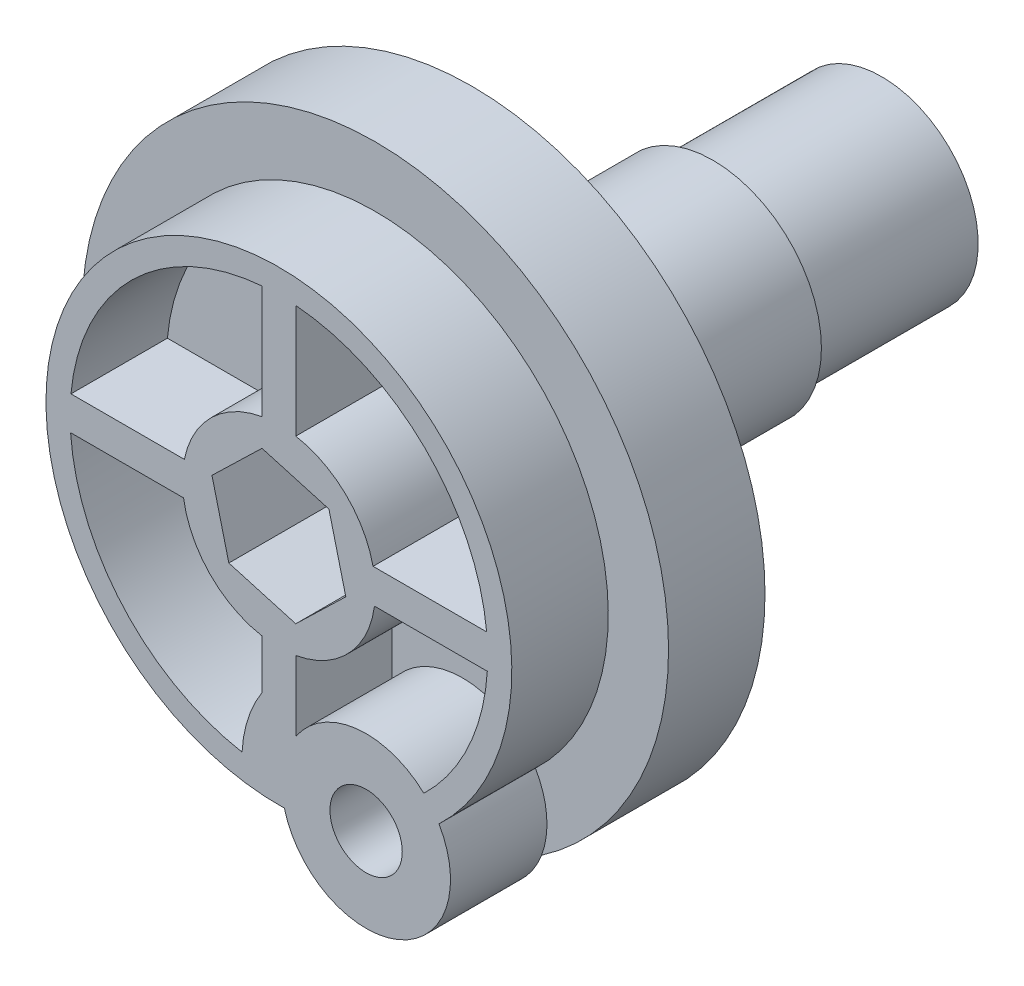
ISO-10303-21;
HEADER;
FILE_DESCRIPTION(('STEP AP214'),'2;1');
FILE_NAME('part.step','',(''),(''),'','','');
FILE_SCHEMA(('AUTOMOTIVE_DESIGN { 1 0 10303 214 1 1 1 1 }'));
ENDSEC;
DATA;
#1=APPLICATION_CONTEXT('core data for automotive mechanical design processes');
#2=APPLICATION_PROTOCOL_DEFINITION('international standard','automotive_design',2000,#1);
#3=PRODUCT_CONTEXT('',#1,'mechanical');
#4=PRODUCT('Part','Part','',(#3));
#5=PRODUCT_RELATED_PRODUCT_CATEGORY('part','',(#4));
#6=PRODUCT_DEFINITION_FORMATION('','',#4);
#7=PRODUCT_DEFINITION_CONTEXT('part definition',#1,'design');
#8=PRODUCT_DEFINITION('design','',#6,#7);
#9=PRODUCT_DEFINITION_SHAPE('','',#8);
#10=(LENGTH_UNIT() NAMED_UNIT(*) SI_UNIT(.MILLI.,.METRE.));
#11=(NAMED_UNIT(*) PLANE_ANGLE_UNIT() SI_UNIT($,.RADIAN.));
#12=(NAMED_UNIT(*) SI_UNIT($,.STERADIAN.) SOLID_ANGLE_UNIT());
#13=UNCERTAINTY_MEASURE_WITH_UNIT(LENGTH_MEASURE(1.E-05),#10,'distance_accuracy_value','');
#14=(GEOMETRIC_REPRESENTATION_CONTEXT(3) GLOBAL_UNCERTAINTY_ASSIGNED_CONTEXT((#13)) GLOBAL_UNIT_ASSIGNED_CONTEXT((#10,
#11,#12)) REPRESENTATION_CONTEXT('',''));
#15=CARTESIAN_POINT('',(0.,0.,0.));
#16=DIRECTION('',(0.,0.,1.));
#17=DIRECTION('',(1.,0.,0.));
#18=AXIS2_PLACEMENT_3D('',#15,#16,#17);
#19=CARTESIAN_POINT('',(0.,0.,-12.));
#20=DIRECTION('',(0.,0.,-1.));
#21=DIRECTION('',(-1.,0.,0.));
#22=AXIS2_PLACEMENT_3D('',#19,#20,#21);
#23=PLANE('',#22);
#24=CARTESIAN_POINT('',(0.,0.,-12.));
#25=DIRECTION('',(0.,0.,-1.));
#26=DIRECTION('',(-1.,0.,0.));
#27=AXIS2_PLACEMENT_3D('',#24,#25,#26);
#28=CIRCLE('',#27,4.5);
#29=CARTESIAN_POINT('',(-4.5,0.,-12.));
#30=VERTEX_POINT('',#29);
#31=EDGE_CURVE('E567',#30,#30,#28,.T.);
#32=ORIENTED_EDGE('',*,*,#31,.T.);
#33=EDGE_LOOP('',(#32));
#34=FACE_BOUND('',#33,.T.);
#35=CARTESIAN_POINT('',(0.,0.,-12.));
#36=DIRECTION('',(0.,0.,-1.));
#37=DIRECTION('',(-1.,0.,0.));
#38=AXIS2_PLACEMENT_3D('',#35,#36,#37);
#39=CIRCLE('',#38,4.);
#40=CARTESIAN_POINT('',(-4.,0.,-12.));
#41=VERTEX_POINT('',#40);
#42=EDGE_CURVE('E561',#41,#41,#39,.T.);
#43=ORIENTED_EDGE('',*,*,#42,.F.);
#44=EDGE_LOOP('',(#43));
#45=FACE_BOUND('',#44,.T.);
#46=ADVANCED_FACE('F348',(#34,#45),#23,.T.);
#47=CARTESIAN_POINT('',(0.,0.,0.));
#48=DIRECTION('',(0.,0.,1.));
#49=DIRECTION('',(1.,0.,0.));
#50=AXIS2_PLACEMENT_3D('',#47,#48,#49);
#51=PLANE('',#50);
#52=CARTESIAN_POINT('',(0.,0.,0.));
#53=DIRECTION('',(0.,0.,-1.));
#54=DIRECTION('',(-1.,0.,0.));
#55=AXIS2_PLACEMENT_3D('',#52,#53,#54);
#56=CIRCLE('',#55,11.16);
#57=CARTESIAN_POINT('',(-11.16,0.,0.));
#58=VERTEX_POINT('',#57);
#59=EDGE_CURVE('E746',#58,#58,#56,.T.);
#60=ORIENTED_EDGE('',*,*,#59,.T.);
#61=EDGE_LOOP('',(#60));
#62=FACE_BOUND('',#61,.T.);
#63=CARTESIAN_POINT('',(3.61661920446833,-8.78464942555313,0.));
#64=DIRECTION('',(0.,0.,1.));
#65=DIRECTION('',(1.,0.,0.));
#66=AXIS2_PLACEMENT_3D('',#63,#64,#65);
#67=CIRCLE('',#66,1.5);
#68=CARTESIAN_POINT('',(5.11661920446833,-8.78464942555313,0.));
#69=VERTEX_POINT('',#68);
#70=EDGE_CURVE('E573',#69,#69,#67,.T.);
#71=ORIENTED_EDGE('',*,*,#70,.T.);
#72=EDGE_LOOP('',(#71));
#73=FACE_BOUND('',#72,.T.);
#74=CARTESIAN_POINT('',(0.,0.,0.));
#75=DIRECTION('',(0.,0.,1.));
#76=DIRECTION('',(1.,0.,0.));
#77=AXIS2_PLACEMENT_3D('',#74,#75,#76);
#78=CIRCLE('',#77,4.5);
#79=CARTESIAN_POINT('',(4.5,0.,0.));
#80=VERTEX_POINT('',#79);
#81=EDGE_CURVE('E11',#80,#80,#78,.F.);
#82=ORIENTED_EDGE('',*,*,#81,.F.);
#83=EDGE_LOOP('',(#82));
#84=FACE_BOUND('',#83,.T.);
#85=ADVANCED_FACE('F821',(#62,#73,#84),#51,.F.);
#86=CARTESIAN_POINT('',(0.,0.,2.));
#87=DIRECTION('',(0.,0.,-1.));
#88=DIRECTION('',(-1.,0.,0.));
#89=AXIS2_PLACEMENT_3D('',#86,#87,#88);
#90=CYLINDRICAL_SURFACE('',#89,12.16);
#91=CARTESIAN_POINT('',(0.,0.,2.));
#92=DIRECTION('',(0.,0.,1.));
#93=DIRECTION('',(1.,0.,0.));
#94=AXIS2_PLACEMENT_3D('',#91,#92,#93);
#95=CIRCLE('',#94,12.16);
#96=CARTESIAN_POINT('',(2.15918223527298,-11.9667678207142,2.));
#97=VERTEX_POINT('',#96);
#98=CARTESIAN_POINT('',(6.89200742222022,-10.0182749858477,2.));
#99=VERTEX_POINT('',#98);
#100=EDGE_CURVE('E755',#97,#99,#95,.T.);
#101=ORIENTED_EDGE('',*,*,#100,.F.);
#102=EDGE_CURVE('E754',#99,#97,#95,.T.);
#103=ORIENTED_EDGE('',*,*,#102,.F.);
#104=EDGE_LOOP('',(#101,#103));
#105=FACE_BOUND('',#104,.T.);
#106=CARTESIAN_POINT('',(0.,0.,-2.));
#107=DIRECTION('',(0.,0.,-1.));
#108=DIRECTION('',(-1.,0.,0.));
#109=AXIS2_PLACEMENT_3D('',#106,#107,#108);
#110=CIRCLE('',#109,12.16);
#111=CARTESIAN_POINT('',(-12.16,0.,-2.));
#112=VERTEX_POINT('',#111);
#113=EDGE_CURVE('E752',#112,#112,#110,.T.);
#114=ORIENTED_EDGE('',*,*,#113,.F.);
#115=EDGE_LOOP('',(#114));
#116=FACE_BOUND('',#115,.T.);
#117=ADVANCED_FACE('F350',(#105,#116),#90,.T.);
#118=CARTESIAN_POINT('',(0.,0.,2.));
#119=DIRECTION('',(0.,0.,1.));
#120=DIRECTION('',(1.,0.,0.));
#121=AXIS2_PLACEMENT_3D('',#118,#119,#120);
#122=PLANE('',#121);
#123=CARTESIAN_POINT('',(3.61661920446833,-8.78464942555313,2.));
#124=DIRECTION('',(0.,0.,1.));
#125=DIRECTION('',(1.,0.,0.));
#126=AXIS2_PLACEMENT_3D('',#123,#124,#125);
#127=CIRCLE('',#126,3.5);
#128=CARTESIAN_POINT('',(0.22716042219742,-9.6573287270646,2.));
#129=VERTEX_POINT('',#128);
#130=EDGE_CURVE('E729',#129,#97,#127,.T.);
#131=ORIENTED_EDGE('',*,*,#130,.F.);
#132=CARTESIAN_POINT('',(0.,0.,2.));
#133=DIRECTION('',(0.,0.,1.));
#134=DIRECTION('',(1.,0.,0.));
#135=AXIS2_PLACEMENT_3D('',#132,#133,#134);
#136=CIRCLE('',#135,9.66);
#137=CARTESIAN_POINT('',(6.63802837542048,-7.01798968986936,2.));
#138=VERTEX_POINT('',#137);
#139=EDGE_CURVE('E732',#138,#129,#136,.T.);
#140=ORIENTED_EDGE('',*,*,#139,.F.);
#141=EDGE_CURVE('E356',#99,#138,#127,.T.);
#142=ORIENTED_EDGE('',*,*,#141,.F.);
#143=ORIENTED_EDGE('',*,*,#102,.T.);
#144=EDGE_LOOP('',(#131,#140,#142,#143));
#145=FACE_BOUND('',#144,.T.);
#146=ADVANCED_FACE('F764',(#145),#122,.T.);
#147=CARTESIAN_POINT('',(0.,0.,-2.));
#148=DIRECTION('',(0.,0.,-1.));
#149=DIRECTION('',(-1.,0.,0.));
#150=AXIS2_PLACEMENT_3D('',#147,#148,#149);
#151=PLANE('',#150);
#152=ORIENTED_EDGE('',*,*,#113,.T.);
#153=EDGE_LOOP('',(#152));
#154=FACE_BOUND('',#153,.T.);
#155=CARTESIAN_POINT('',(0.,0.,-2.));
#156=DIRECTION('',(0.,0.,-1.));
#157=DIRECTION('',(-1.,0.,0.));
#158=AXIS2_PLACEMENT_3D('',#155,#156,#157);
#159=CIRCLE('',#158,11.16);
#160=CARTESIAN_POINT('',(-11.16,0.,-2.));
#161=VERTEX_POINT('',#160);
#162=EDGE_CURVE('E749',#161,#161,#159,.T.);
#163=ORIENTED_EDGE('',*,*,#162,.F.);
#164=EDGE_LOOP('',(#163));
#165=FACE_BOUND('',#164,.T.);
#166=ADVANCED_FACE('F917',(#154,#165),#151,.T.);
#167=CARTESIAN_POINT('',(0.,0.,-2.));
#168=DIRECTION('',(0.,0.,1.));
#169=DIRECTION('',(1.,0.,0.));
#170=AXIS2_PLACEMENT_3D('',#167,#168,#169);
#171=CYLINDRICAL_SURFACE('',#170,11.16);
#172=ORIENTED_EDGE('',*,*,#162,.T.);
#173=EDGE_LOOP('',(#172));
#174=FACE_BOUND('',#173,.T.);
#175=ORIENTED_EDGE('',*,*,#59,.F.);
#176=EDGE_LOOP('',(#175));
#177=FACE_BOUND('',#176,.T.);
#178=ADVANCED_FACE('F909',(#174,#177),#171,.F.);
#179=CARTESIAN_POINT('',(1.80830960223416,-4.39232471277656,2.));
#180=DIRECTION('',(0.,0.,1.));
#181=DIRECTION('',(1.,0.,0.));
#182=AXIS2_PLACEMENT_3D('',#179,#180,#181);
#183=PLANE('',#182);
#184=EDGE_CURVE('E728',#97,#99,#127,.T.);
#185=ORIENTED_EDGE('',*,*,#184,.F.);
#186=ORIENTED_EDGE('',*,*,#100,.T.);
#187=EDGE_LOOP('',(#185,#186));
#188=FACE_BOUND('',#187,.T.);
#189=ADVANCED_FACE('F767',(#188),#183,.F.);
#190=CARTESIAN_POINT('',(1.80830960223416,-4.39232471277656,6.));
#191=DIRECTION('',(0.,0.,1.));
#192=DIRECTION('',(1.,0.,0.));
#193=AXIS2_PLACEMENT_3D('',#190,#191,#192);
#194=PLANE('',#193);
#195=CARTESIAN_POINT('',(3.61661920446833,-8.78464942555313,6.));
#196=DIRECTION('',(0.,0.,1.));
#197=DIRECTION('',(1.,0.,0.));
#198=AXIS2_PLACEMENT_3D('',#195,#196,#197);
#199=CIRCLE('',#198,1.5);
#200=CARTESIAN_POINT('',(5.11661920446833,-8.78464942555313,6.));
#201=VERTEX_POINT('',#200);
#202=EDGE_CURVE('E570',#201,#201,#199,.T.);
#203=ORIENTED_EDGE('',*,*,#202,.F.);
#204=EDGE_LOOP('',(#203));
#205=FACE_BOUND('',#204,.T.);
#206=DIRECTION('',(0.718934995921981,0.695077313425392,0.));
#207=VECTOR('',#206,1.);
#208=CARTESIAN_POINT('',(0.7,-2.80059517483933,6.));
#209=LINE('',#208,#207);
#210=CARTESIAN_POINT('',(0.7,-2.80059517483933,6.));
#211=VERTEX_POINT('',#210);
#212=CARTESIAN_POINT('',(2.77538656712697,-0.794079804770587,6.));
#213=VERTEX_POINT('',#212);
#214=EDGE_CURVE('E608',#211,#213,#209,.T.);
#215=ORIENTED_EDGE('',*,*,#214,.F.);
#216=DIRECTION('',(0.961422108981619,-0.275077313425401,0.));
#217=VECTOR('',#216,1.);
#218=CARTESIAN_POINT('',(-2.075386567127,-2.00651537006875,6.));
#219=LINE('',#218,#217);
#220=CARTESIAN_POINT('',(-2.075386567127,-2.00651537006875,6.));
#221=VERTEX_POINT('',#220);
#222=EDGE_CURVE('E606',#221,#211,#219,.T.);
#223=ORIENTED_EDGE('',*,*,#222,.F.);
#224=DIRECTION('',(0.242487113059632,-0.970154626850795,0.));
#225=VECTOR('',#224,1.);
#226=CARTESIAN_POINT('',(-2.77538656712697,0.794079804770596,6.));
#227=LINE('',#226,#225);
#228=CARTESIAN_POINT('',(-2.77538656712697,0.794079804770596,6.));
#229=VERTEX_POINT('',#228);
#230=EDGE_CURVE('E615',#229,#221,#227,.T.);
#231=ORIENTED_EDGE('',*,*,#230,.F.);
#232=DIRECTION('',(-0.718934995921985,-0.695077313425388,0.));
#233=VECTOR('',#232,1.);
#234=CARTESIAN_POINT('',(-0.699999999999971,2.80059517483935,6.));
#235=LINE('',#234,#233);
#236=CARTESIAN_POINT('',(-0.699999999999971,2.80059517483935,6.));
#237=VERTEX_POINT('',#236);
#238=EDGE_CURVE('E536',#237,#229,#235,.T.);
#239=ORIENTED_EDGE('',*,*,#238,.F.);
#240=DIRECTION('',(-0.961422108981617,0.275077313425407,0.));
#241=VECTOR('',#240,1.);
#242=CARTESIAN_POINT('',(2.075386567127,2.00651537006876,6.));
#243=LINE('',#242,#241);
#244=CARTESIAN_POINT('',(2.075386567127,2.00651537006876,6.));
#245=VERTEX_POINT('',#244);
#246=EDGE_CURVE('E612',#245,#237,#243,.T.);
#247=ORIENTED_EDGE('',*,*,#246,.F.);
#248=DIRECTION('',(-0.242487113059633,0.970154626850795,0.));
#249=VECTOR('',#248,1.);
#250=CARTESIAN_POINT('',(2.77538656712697,-0.794079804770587,6.));
#251=LINE('',#250,#249);
#252=EDGE_CURVE('E610',#213,#245,#251,.T.);
#253=ORIENTED_EDGE('',*,*,#252,.F.);
#254=EDGE_LOOP('',(#215,#223,#231,#239,#247,#253));
#255=FACE_BOUND('',#254,.T.);
#256=DIRECTION('',(0.,1.,0.));
#257=VECTOR('',#256,1.);
#258=CARTESIAN_POINT('',(-0.7,-3.93827373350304,6.));
#259=LINE('',#258,#257);
#260=CARTESIAN_POINT('',(-0.699999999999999,-5.97450650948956,6.));
#261=VERTEX_POINT('',#260);
#262=CARTESIAN_POINT('',(-0.700000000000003,-3.93827373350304,6.));
#263=VERTEX_POINT('',#262);
#264=EDGE_CURVE('E679',#261,#263,#259,.T.);
#265=ORIENTED_EDGE('',*,*,#264,.F.);
#266=CARTESIAN_POINT('',(3.61661920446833,-8.78464942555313,6.));
#267=DIRECTION('',(0.,0.,-1.));
#268=DIRECTION('',(1.,0.,0.));
#269=AXIS2_PLACEMENT_3D('',#266,#267,#268);
#270=CIRCLE('',#269,5.15073825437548);
#271=CARTESIAN_POINT('',(-1.52753074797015,-8.52421549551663,6.));
#272=VERTEX_POINT('',#271);
#273=EDGE_CURVE('E677',#272,#261,#270,.T.);
#274=ORIENTED_EDGE('',*,*,#273,.F.);
#275=CARTESIAN_POINT('',(0.,0.,6.));
#276=DIRECTION('',(0.,0.,1.));
#277=DIRECTION('',(1.,0.,0.));
#278=AXIS2_PLACEMENT_3D('',#275,#276,#277);
#279=CIRCLE('',#278,8.66);
#280=CARTESIAN_POINT('',(-8.63877657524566,-0.605920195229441,6.));
#281=VERTEX_POINT('',#280);
#282=EDGE_CURVE('E686',#281,#272,#279,.T.);
#283=ORIENTED_EDGE('',*,*,#282,.F.);
#284=DIRECTION('',(-1.,0.,0.));
#285=VECTOR('',#284,1.);
#286=CARTESIAN_POINT('',(-3.95384126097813,-0.605920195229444,6.));
#287=LINE('',#286,#285);
#288=CARTESIAN_POINT('',(-3.95384126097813,-0.605920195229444,6.));
#289=VERTEX_POINT('',#288);
#290=EDGE_CURVE('E683',#289,#281,#287,.T.);
#291=ORIENTED_EDGE('',*,*,#290,.F.);
#292=CARTESIAN_POINT('',(0.,0.,6.));
#293=DIRECTION('',(0.,0.,-1.));
#294=DIRECTION('',(1.,0.,0.));
#295=AXIS2_PLACEMENT_3D('',#292,#293,#294);
#296=CIRCLE('',#295,4.);
#297=EDGE_CURVE('E681',#263,#289,#296,.T.);
#298=ORIENTED_EDGE('',*,*,#297,.F.);
#299=EDGE_LOOP('',(#265,#274,#283,#291,#298));
#300=FACE_BOUND('',#299,.T.);
#301=CARTESIAN_POINT('',(3.61661920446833,-8.78464942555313,6.));
#302=DIRECTION('',(0.,0.,1.));
#303=DIRECTION('',(1.,0.,0.));
#304=AXIS2_PLACEMENT_3D('',#301,#302,#303);
#305=CIRCLE('',#304,3.5);
#306=CARTESIAN_POINT('',(0.22716042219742,-9.6573287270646,6.));
#307=VERTEX_POINT('',#306);
#308=CARTESIAN_POINT('',(6.63802837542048,-7.01798968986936,6.));
#309=VERTEX_POINT('',#308);
#310=EDGE_CURVE('E735',#307,#309,#305,.T.);
#311=ORIENTED_EDGE('',*,*,#310,.T.);
#312=CARTESIAN_POINT('',(0.,0.,6.));
#313=DIRECTION('',(0.,0.,1.));
#314=DIRECTION('',(1.,0.,0.));
#315=AXIS2_PLACEMENT_3D('',#312,#313,#314);
#316=CIRCLE('',#315,9.66);
#317=EDGE_CURVE('E738',#309,#307,#316,.T.);
#318=ORIENTED_EDGE('',*,*,#317,.T.);
#319=EDGE_LOOP('',(#311,#318));
#320=FACE_BOUND('',#319,.T.);
#321=DIRECTION('',(1.,0.,0.));
#322=VECTOR('',#321,1.);
#323=CARTESIAN_POINT('',(-3.92038738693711,0.794079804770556,6.));
#324=LINE('',#323,#322);
#325=CARTESIAN_POINT('',(-8.62351652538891,0.794079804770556,6.));
#326=VERTEX_POINT('',#325);
#327=CARTESIAN_POINT('',(-3.92038738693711,0.794079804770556,6.));
#328=VERTEX_POINT('',#327);
#329=EDGE_CURVE('E712',#326,#328,#324,.T.);
#330=ORIENTED_EDGE('',*,*,#329,.F.);
#331=CARTESIAN_POINT('',(0.,0.,6.));
#332=DIRECTION('',(0.,0.,1.));
#333=DIRECTION('',(-1.,0.,0.));
#334=AXIS2_PLACEMENT_3D('',#331,#332,#333);
#335=CIRCLE('',#334,8.66);
#336=CARTESIAN_POINT('',(-0.700000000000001,8.63166264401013,6.));
#337=VERTEX_POINT('',#336);
#338=EDGE_CURVE('E710',#337,#326,#335,.T.);
#339=ORIENTED_EDGE('',*,*,#338,.F.);
#340=DIRECTION('',(0.,1.,0.));
#341=VECTOR('',#340,1.);
#342=CARTESIAN_POINT('',(-0.700000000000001,8.63166264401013,6.));
#343=LINE('',#342,#341);
#344=CARTESIAN_POINT('',(-0.7,3.93827373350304,6.));
#345=VERTEX_POINT('',#344);
#346=EDGE_CURVE('E717',#345,#337,#343,.T.);
#347=ORIENTED_EDGE('',*,*,#346,.F.);
#348=CARTESIAN_POINT('',(0.,0.,6.));
#349=DIRECTION('',(0.,0.,-1.));
#350=DIRECTION('',(-1.,0.,0.));
#351=AXIS2_PLACEMENT_3D('',#348,#349,#350);
#352=CIRCLE('',#351,4.);
#353=EDGE_CURVE('E714',#328,#345,#352,.T.);
#354=ORIENTED_EDGE('',*,*,#353,.F.);
#355=EDGE_LOOP('',(#330,#339,#347,#354));
#356=FACE_BOUND('',#355,.T.);
#357=CARTESIAN_POINT('',(0.,0.,6.));
#358=DIRECTION('',(0.,0.,1.));
#359=DIRECTION('',(1.,0.,0.));
#360=AXIS2_PLACEMENT_3D('',#357,#358,#359);
#361=CIRCLE('',#360,8.66);
#362=CARTESIAN_POINT('',(6.01217643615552,-6.23292343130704,6.));
#363=VERTEX_POINT('',#362);
#364=CARTESIAN_POINT('',(8.64350312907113,-0.53427863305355,6.));
#365=VERTEX_POINT('',#364);
#366=EDGE_CURVE('E642',#363,#365,#361,.T.);
#367=ORIENTED_EDGE('',*,*,#366,.F.);
#368=CARTESIAN_POINT('',(3.61661920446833,-8.78464942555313,6.));
#369=DIRECTION('',(0.,0.,-1.));
#370=DIRECTION('',(1.,0.,0.));
#371=AXIS2_PLACEMENT_3D('',#368,#369,#370);
#372=CIRCLE('',#371,3.5);
#373=CARTESIAN_POINT('',(0.699999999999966,-6.84988008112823,6.));
#374=VERTEX_POINT('',#373);
#375=EDGE_CURVE('E640',#374,#363,#372,.T.);
#376=ORIENTED_EDGE('',*,*,#375,.F.);
#377=DIRECTION('',(0.,-1.,0.));
#378=VECTOR('',#377,1.);
#379=CARTESIAN_POINT('',(0.699999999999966,-3.93827373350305,6.));
#380=LINE('',#379,#378);
#381=CARTESIAN_POINT('',(0.699999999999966,-3.93827373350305,6.));
#382=VERTEX_POINT('',#381);
#383=EDGE_CURVE('E649',#382,#374,#380,.T.);
#384=ORIENTED_EDGE('',*,*,#383,.F.);
#385=CARTESIAN_POINT('',(0.,0.,6.));
#386=DIRECTION('',(0.,0.,-1.));
#387=DIRECTION('',(1.,0.,0.));
#388=AXIS2_PLACEMENT_3D('',#385,#386,#387);
#389=CIRCLE('',#388,4.);
#390=CARTESIAN_POINT('',(3.96415770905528,-0.534278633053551,6.));
#391=VERTEX_POINT('',#390);
#392=EDGE_CURVE('E646',#391,#382,#389,.T.);
#393=ORIENTED_EDGE('',*,*,#392,.F.);
#394=DIRECTION('',(-1.,0.,0.));
#395=VECTOR('',#394,1.);
#396=CARTESIAN_POINT('',(3.96415770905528,-0.534278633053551,6.));
#397=LINE('',#396,#395);
#398=EDGE_CURVE('E644',#365,#391,#397,.T.);
#399=ORIENTED_EDGE('',*,*,#398,.F.);
#400=EDGE_LOOP('',(#367,#376,#384,#393,#399));
#401=FACE_BOUND('',#400,.T.);
#402=DIRECTION('',(0.,-1.,0.));
#403=VECTOR('',#402,1.);
#404=CARTESIAN_POINT('',(0.699999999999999,8.63166264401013,6.));
#405=LINE('',#404,#403);
#406=CARTESIAN_POINT('',(0.699999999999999,8.63166264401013,6.));
#407=VERTEX_POINT('',#406);
#408=CARTESIAN_POINT('',(0.7,3.93827373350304,6.));
#409=VERTEX_POINT('',#408);
#410=EDGE_CURVE('E590',#407,#409,#405,.T.);
#411=ORIENTED_EDGE('',*,*,#410,.F.);
#412=CARTESIAN_POINT('',(0.,0.,6.));
#413=DIRECTION('',(0.,0.,1.));
#414=DIRECTION('',(1.,0.,0.));
#415=AXIS2_PLACEMENT_3D('',#412,#413,#414);
#416=CIRCLE('',#415,8.66);
#417=CARTESIAN_POINT('',(8.61661920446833,0.865721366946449,6.));
#418=VERTEX_POINT('',#417);
#419=EDGE_CURVE('E588',#418,#407,#416,.T.);
#420=ORIENTED_EDGE('',*,*,#419,.F.);
#421=DIRECTION('',(1.,0.,0.));
#422=VECTOR('',#421,1.);
#423=CARTESIAN_POINT('',(8.61661920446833,0.865721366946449,6.));
#424=LINE('',#423,#422);
#425=CARTESIAN_POINT('',(3.90519225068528,0.865721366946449,6.));
#426=VERTEX_POINT('',#425);
#427=EDGE_CURVE('E595',#426,#418,#424,.T.);
#428=ORIENTED_EDGE('',*,*,#427,.F.);
#429=CARTESIAN_POINT('',(0.,0.,6.));
#430=DIRECTION('',(0.,0.,-1.));
#431=DIRECTION('',(1.,0.,0.));
#432=AXIS2_PLACEMENT_3D('',#429,#430,#431);
#433=CIRCLE('',#432,4.);
#434=EDGE_CURVE('E592',#409,#426,#433,.T.);
#435=ORIENTED_EDGE('',*,*,#434,.F.);
#436=EDGE_LOOP('',(#411,#420,#428,#435));
#437=FACE_BOUND('',#436,.T.);
#438=ADVANCED_FACE('F776',(#205,#255,#300,#320,#356,#401,#437),#194,.T.);
#439=CARTESIAN_POINT('',(3.61661920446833,-8.78464942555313,6.));
#440=DIRECTION('',(0.,0.,-1.));
#441=DIRECTION('',(-1.,0.,0.));
#442=AXIS2_PLACEMENT_3D('',#439,#440,#441);
#443=CYLINDRICAL_SURFACE('',#442,3.5);
#444=ORIENTED_EDGE('',*,*,#130,.T.);
#445=ORIENTED_EDGE('',*,*,#184,.T.);
#446=ORIENTED_EDGE('',*,*,#141,.T.);
#447=DIRECTION('',(0.,0.,-1.));
#448=VECTOR('',#447,1.);
#449=CARTESIAN_POINT('',(6.63802837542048,-7.01798968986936,6.));
#450=LINE('',#449,#448);
#451=EDGE_CURVE('E743',#309,#138,#450,.T.);
#452=ORIENTED_EDGE('',*,*,#451,.F.);
#453=ORIENTED_EDGE('',*,*,#310,.F.);
#454=DIRECTION('',(0.,0.,-1.));
#455=VECTOR('',#454,1.);
#456=CARTESIAN_POINT('',(0.22716042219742,-9.6573287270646,6.));
#457=LINE('',#456,#455);
#458=EDGE_CURVE('E740',#307,#129,#457,.T.);
#459=ORIENTED_EDGE('',*,*,#458,.T.);
#460=EDGE_LOOP('',(#444,#445,#446,#452,#453,#459));
#461=FACE_BOUND('',#460,.T.);
#462=ADVANCED_FACE('F769',(#461),#443,.T.);
#463=CARTESIAN_POINT('',(0.,0.,6.));
#464=DIRECTION('',(0.,0.,-1.));
#465=DIRECTION('',(-1.,0.,0.));
#466=AXIS2_PLACEMENT_3D('',#463,#464,#465);
#467=CYLINDRICAL_SURFACE('',#466,9.66);
#468=ORIENTED_EDGE('',*,*,#139,.T.);
#469=ORIENTED_EDGE('',*,*,#458,.F.);
#470=ORIENTED_EDGE('',*,*,#317,.F.);
#471=ORIENTED_EDGE('',*,*,#451,.T.);
#472=EDGE_LOOP('',(#468,#469,#470,#471));
#473=FACE_BOUND('',#472,.T.);
#474=ADVANCED_FACE('F774',(#473),#467,.T.);
#475=CARTESIAN_POINT('',(0.,0.,6.));
#476=DIRECTION('',(0.,0.,-1.));
#477=DIRECTION('',(-1.,0.,0.));
#478=AXIS2_PLACEMENT_3D('',#475,#476,#477);
#479=CYLINDRICAL_SURFACE('',#478,8.66);
#480=CARTESIAN_POINT('',(0.,0.,2.));
#481=DIRECTION('',(0.,0.,1.));
#482=DIRECTION('',(-1.,0.,0.));
#483=AXIS2_PLACEMENT_3D('',#480,#481,#482);
#484=CIRCLE('',#483,8.66);
#485=CARTESIAN_POINT('',(-0.700000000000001,8.63166264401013,2.));
#486=VERTEX_POINT('',#485);
#487=CARTESIAN_POINT('',(-8.62351652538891,0.794079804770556,2.));
#488=VERTEX_POINT('',#487);
#489=EDGE_CURVE('E698',#486,#488,#484,.T.);
#490=ORIENTED_EDGE('',*,*,#489,.F.);
#491=DIRECTION('',(0.,0.,-1.));
#492=VECTOR('',#491,1.);
#493=CARTESIAN_POINT('',(-0.700000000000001,8.63166264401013,6.));
#494=LINE('',#493,#492);
#495=EDGE_CURVE('E719',#337,#486,#494,.T.);
#496=ORIENTED_EDGE('',*,*,#495,.F.);
#497=ORIENTED_EDGE('',*,*,#338,.T.);
#498=DIRECTION('',(0.,0.,-1.));
#499=VECTOR('',#498,1.);
#500=CARTESIAN_POINT('',(-8.62351652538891,0.794079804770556,6.));
#501=LINE('',#500,#499);
#502=EDGE_CURVE('E725',#326,#488,#501,.T.);
#503=ORIENTED_EDGE('',*,*,#502,.T.);
#504=EDGE_LOOP('',(#490,#496,#497,#503));
#505=FACE_BOUND('',#504,.T.);
#506=ADVANCED_FACE('F903',(#505),#479,.F.);
#507=CARTESIAN_POINT('',(-3.92038738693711,0.794079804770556,6.));
#508=DIRECTION('',(0.,1.,0.));
#509=DIRECTION('',(-1.,0.,0.));
#510=AXIS2_PLACEMENT_3D('',#507,#508,#509);
#511=PLANE('',#510);
#512=DIRECTION('',(1.,0.,0.));
#513=VECTOR('',#512,1.);
#514=CARTESIAN_POINT('',(-3.92038738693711,0.794079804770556,2.));
#515=LINE('',#514,#513);
#516=CARTESIAN_POINT('',(-3.92038738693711,0.794079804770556,2.));
#517=VERTEX_POINT('',#516);
#518=EDGE_CURVE('E701',#488,#517,#515,.T.);
#519=ORIENTED_EDGE('',*,*,#518,.F.);
#520=ORIENTED_EDGE('',*,*,#502,.F.);
#521=ORIENTED_EDGE('',*,*,#329,.T.);
#522=DIRECTION('',(0.,0.,-1.));
#523=VECTOR('',#522,1.);
#524=CARTESIAN_POINT('',(-3.92038738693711,0.794079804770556,6.));
#525=LINE('',#524,#523);
#526=EDGE_CURVE('E723',#328,#517,#525,.T.);
#527=ORIENTED_EDGE('',*,*,#526,.T.);
#528=EDGE_LOOP('',(#519,#520,#521,#527));
#529=FACE_BOUND('',#528,.T.);
#530=ADVANCED_FACE('F899',(#529),#511,.T.);
#531=CARTESIAN_POINT('',(0.,0.,6.));
#532=DIRECTION('',(0.,0.,-1.));
#533=DIRECTION('',(-1.,0.,0.));
#534=AXIS2_PLACEMENT_3D('',#531,#532,#533);
#535=CYLINDRICAL_SURFACE('',#534,4.);
#536=CARTESIAN_POINT('',(0.,0.,2.));
#537=DIRECTION('',(0.,0.,-1.));
#538=DIRECTION('',(-1.,0.,0.));
#539=AXIS2_PLACEMENT_3D('',#536,#537,#538);
#540=CIRCLE('',#539,4.);
#541=CARTESIAN_POINT('',(-0.7,3.93827373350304,2.));
#542=VERTEX_POINT('',#541);
#543=EDGE_CURVE('E704',#517,#542,#540,.T.);
#544=ORIENTED_EDGE('',*,*,#543,.F.);
#545=ORIENTED_EDGE('',*,*,#526,.F.);
#546=ORIENTED_EDGE('',*,*,#353,.T.);
#547=DIRECTION('',(0.,0.,-1.));
#548=VECTOR('',#547,1.);
#549=CARTESIAN_POINT('',(-0.7,3.93827373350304,6.));
#550=LINE('',#549,#548);
#551=EDGE_CURVE('E721',#345,#542,#550,.T.);
#552=ORIENTED_EDGE('',*,*,#551,.T.);
#553=EDGE_LOOP('',(#544,#545,#546,#552));
#554=FACE_BOUND('',#553,.T.);
#555=ADVANCED_FACE('F895',(#554),#535,.T.);
#556=CARTESIAN_POINT('',(-0.700000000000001,8.63166264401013,6.));
#557=DIRECTION('',(-1.,0.,0.));
#558=DIRECTION('',(0.,-1.,0.));
#559=AXIS2_PLACEMENT_3D('',#556,#557,#558);
#560=PLANE('',#559);
#561=DIRECTION('',(0.,1.,0.));
#562=VECTOR('',#561,1.);
#563=CARTESIAN_POINT('',(-0.700000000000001,8.63166264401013,2.));
#564=LINE('',#563,#562);
#565=EDGE_CURVE('E707',#542,#486,#564,.T.);
#566=ORIENTED_EDGE('',*,*,#565,.F.);
#567=ORIENTED_EDGE('',*,*,#551,.F.);
#568=ORIENTED_EDGE('',*,*,#346,.T.);
#569=ORIENTED_EDGE('',*,*,#495,.T.);
#570=EDGE_LOOP('',(#566,#567,#568,#569));
#571=FACE_BOUND('',#570,.T.);
#572=ADVANCED_FACE('F892',(#571),#560,.T.);
#573=CARTESIAN_POINT('',(3.61661920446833,-8.78464942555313,6.));
#574=DIRECTION('',(0.,0.,-1.));
#575=DIRECTION('',(-1.,0.,0.));
#576=AXIS2_PLACEMENT_3D('',#573,#574,#575);
#577=CYLINDRICAL_SURFACE('',#576,5.15073825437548);
#578=CARTESIAN_POINT('',(3.61661920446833,-8.78464942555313,2.));
#579=DIRECTION('',(0.,0.,-1.));
#580=DIRECTION('',(1.,0.,0.));
#581=AXIS2_PLACEMENT_3D('',#578,#579,#580);
#582=CIRCLE('',#581,5.15073825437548);
#583=CARTESIAN_POINT('',(-1.52753074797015,-8.52421549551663,2.));
#584=VERTEX_POINT('',#583);
#585=CARTESIAN_POINT('',(-0.699999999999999,-5.97450650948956,2.));
#586=VERTEX_POINT('',#585);
#587=EDGE_CURVE('E662',#584,#586,#582,.T.);
#588=ORIENTED_EDGE('',*,*,#587,.F.);
#589=DIRECTION('',(0.,0.,-1.));
#590=VECTOR('',#589,1.);
#591=CARTESIAN_POINT('',(-1.52753074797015,-8.52421549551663,6.));
#592=LINE('',#591,#590);
#593=EDGE_CURVE('E371',#272,#584,#592,.T.);
#594=ORIENTED_EDGE('',*,*,#593,.F.);
#595=ORIENTED_EDGE('',*,*,#273,.T.);
#596=DIRECTION('',(0.,0.,-1.));
#597=VECTOR('',#596,1.);
#598=CARTESIAN_POINT('',(-0.699999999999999,-5.97450650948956,6.));
#599=LINE('',#598,#597);
#600=EDGE_CURVE('E695',#261,#586,#599,.T.);
#601=ORIENTED_EDGE('',*,*,#600,.T.);
#602=EDGE_LOOP('',(#588,#594,#595,#601));
#603=FACE_BOUND('',#602,.T.);
#604=ADVANCED_FACE('F873',(#603),#577,.T.);
#605=CARTESIAN_POINT('',(-0.7,-3.93827373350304,6.));
#606=DIRECTION('',(-1.,0.,0.));
#607=DIRECTION('',(0.,-1.,0.));
#608=AXIS2_PLACEMENT_3D('',#605,#606,#607);
#609=PLANE('',#608);
#610=DIRECTION('',(0.,1.,0.));
#611=VECTOR('',#610,1.);
#612=CARTESIAN_POINT('',(-0.7,-3.93827373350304,2.));
#613=LINE('',#612,#611);
#614=CARTESIAN_POINT('',(-0.700000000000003,-3.93827373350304,2.));
#615=VERTEX_POINT('',#614);
#616=EDGE_CURVE('E665',#586,#615,#613,.T.);
#617=ORIENTED_EDGE('',*,*,#616,.F.);
#618=ORIENTED_EDGE('',*,*,#600,.F.);
#619=ORIENTED_EDGE('',*,*,#264,.T.);
#620=DIRECTION('',(0.,0.,-1.));
#621=VECTOR('',#620,1.);
#622=CARTESIAN_POINT('',(-0.700000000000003,-3.93827373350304,6.));
#623=LINE('',#622,#621);
#624=EDGE_CURVE('E693',#263,#615,#623,.T.);
#625=ORIENTED_EDGE('',*,*,#624,.T.);
#626=EDGE_LOOP('',(#617,#618,#619,#625));
#627=FACE_BOUND('',#626,.T.);
#628=ADVANCED_FACE('F865',(#627),#609,.T.);
#629=CARTESIAN_POINT('',(0.,0.,6.));
#630=DIRECTION('',(0.,0.,-1.));
#631=DIRECTION('',(-1.,0.,0.));
#632=AXIS2_PLACEMENT_3D('',#629,#630,#631);
#633=CYLINDRICAL_SURFACE('',#632,4.);
#634=CARTESIAN_POINT('',(0.,0.,2.));
#635=DIRECTION('',(0.,0.,-1.));
#636=DIRECTION('',(1.,0.,0.));
#637=AXIS2_PLACEMENT_3D('',#634,#635,#636);
#638=CIRCLE('',#637,4.);
#639=CARTESIAN_POINT('',(-3.95384126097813,-0.605920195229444,2.));
#640=VERTEX_POINT('',#639);
#641=EDGE_CURVE('E668',#615,#640,#638,.T.);
#642=ORIENTED_EDGE('',*,*,#641,.F.);
#643=ORIENTED_EDGE('',*,*,#624,.F.);
#644=ORIENTED_EDGE('',*,*,#297,.T.);
#645=DIRECTION('',(0.,0.,-1.));
#646=VECTOR('',#645,1.);
#647=CARTESIAN_POINT('',(-3.95384126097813,-0.605920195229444,6.));
#648=LINE('',#647,#646);
#649=EDGE_CURVE('E691',#289,#640,#648,.T.);
#650=ORIENTED_EDGE('',*,*,#649,.T.);
#651=EDGE_LOOP('',(#642,#643,#644,#650));
#652=FACE_BOUND('',#651,.T.);
#653=ADVANCED_FACE('F868',(#652),#633,.T.);
#654=CARTESIAN_POINT('',(-3.95384126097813,-0.605920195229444,6.));
#655=DIRECTION('',(0.,-1.,0.));
#656=DIRECTION('',(1.,0.,0.));
#657=AXIS2_PLACEMENT_3D('',#654,#655,#656);
#658=PLANE('',#657);
#659=DIRECTION('',(-1.,0.,0.));
#660=VECTOR('',#659,1.);
#661=CARTESIAN_POINT('',(-3.95384126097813,-0.605920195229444,2.));
#662=LINE('',#661,#660);
#663=CARTESIAN_POINT('',(-8.63877657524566,-0.605920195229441,2.));
#664=VERTEX_POINT('',#663);
#665=EDGE_CURVE('E671',#640,#664,#662,.T.);
#666=ORIENTED_EDGE('',*,*,#665,.F.);
#667=ORIENTED_EDGE('',*,*,#649,.F.);
#668=ORIENTED_EDGE('',*,*,#290,.T.);
#669=DIRECTION('',(0.,0.,-1.));
#670=VECTOR('',#669,1.);
#671=CARTESIAN_POINT('',(-8.63877657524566,-0.605920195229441,6.));
#672=LINE('',#671,#670);
#673=EDGE_CURVE('E689',#281,#664,#672,.T.);
#674=ORIENTED_EDGE('',*,*,#673,.T.);
#675=EDGE_LOOP('',(#666,#667,#668,#674));
#676=FACE_BOUND('',#675,.T.);
#677=ADVANCED_FACE('F876',(#676),#658,.T.);
#678=CARTESIAN_POINT('',(0.,0.,6.));
#679=DIRECTION('',(0.,0.,-1.));
#680=DIRECTION('',(-1.,0.,0.));
#681=AXIS2_PLACEMENT_3D('',#678,#679,#680);
#682=CYLINDRICAL_SURFACE('',#681,8.66);
#683=CARTESIAN_POINT('',(0.,0.,2.));
#684=DIRECTION('',(0.,0.,1.));
#685=DIRECTION('',(1.,0.,0.));
#686=AXIS2_PLACEMENT_3D('',#683,#684,#685);
#687=CIRCLE('',#686,8.66);
#688=EDGE_CURVE('E674',#664,#584,#687,.T.);
#689=ORIENTED_EDGE('',*,*,#688,.F.);
#690=ORIENTED_EDGE('',*,*,#673,.F.);
#691=ORIENTED_EDGE('',*,*,#282,.T.);
#692=ORIENTED_EDGE('',*,*,#593,.T.);
#693=EDGE_LOOP('',(#689,#690,#691,#692));
#694=FACE_BOUND('',#693,.T.);
#695=ADVANCED_FACE('F874',(#694),#682,.F.);
#696=CARTESIAN_POINT('',(3.61661920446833,-8.78464942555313,6.));
#697=DIRECTION('',(0.,0.,-1.));
#698=DIRECTION('',(-1.,0.,0.));
#699=AXIS2_PLACEMENT_3D('',#696,#697,#698);
#700=CYLINDRICAL_SURFACE('',#699,3.5);
#701=CARTESIAN_POINT('',(3.61661920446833,-8.78464942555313,2.));
#702=DIRECTION('',(0.,0.,-1.));
#703=DIRECTION('',(1.,0.,0.));
#704=AXIS2_PLACEMENT_3D('',#701,#702,#703);
#705=CIRCLE('',#704,3.5);
#706=CARTESIAN_POINT('',(0.699999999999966,-6.84988008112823,2.));
#707=VERTEX_POINT('',#706);
#708=CARTESIAN_POINT('',(6.01217643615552,-6.23292343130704,2.));
#709=VERTEX_POINT('',#708);
#710=EDGE_CURVE('E625',#707,#709,#705,.T.);
#711=ORIENTED_EDGE('',*,*,#710,.F.);
#712=DIRECTION('',(0.,0.,-1.));
#713=VECTOR('',#712,1.);
#714=CARTESIAN_POINT('',(0.699999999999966,-6.84988008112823,6.));
#715=LINE('',#714,#713);
#716=EDGE_CURVE('E651',#374,#707,#715,.T.);
#717=ORIENTED_EDGE('',*,*,#716,.F.);
#718=ORIENTED_EDGE('',*,*,#375,.T.);
#719=DIRECTION('',(0.,0.,-1.));
#720=VECTOR('',#719,1.);
#721=CARTESIAN_POINT('',(6.01217643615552,-6.23292343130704,6.));
#722=LINE('',#721,#720);
#723=EDGE_CURVE('E659',#363,#709,#722,.T.);
#724=ORIENTED_EDGE('',*,*,#723,.T.);
#725=EDGE_LOOP('',(#711,#717,#718,#724));
#726=FACE_BOUND('',#725,.T.);
#727=ADVANCED_FACE('F883',(#726),#700,.T.);
#728=CARTESIAN_POINT('',(0.,0.,6.));
#729=DIRECTION('',(0.,0.,-1.));
#730=DIRECTION('',(-1.,0.,0.));
#731=AXIS2_PLACEMENT_3D('',#728,#729,#730);
#732=CYLINDRICAL_SURFACE('',#731,8.66);
#733=CARTESIAN_POINT('',(0.,0.,2.));
#734=DIRECTION('',(0.,0.,1.));
#735=DIRECTION('',(1.,0.,0.));
#736=AXIS2_PLACEMENT_3D('',#733,#734,#735);
#737=CIRCLE('',#736,8.66);
#738=CARTESIAN_POINT('',(8.64350312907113,-0.53427863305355,2.));
#739=VERTEX_POINT('',#738);
#740=EDGE_CURVE('E628',#709,#739,#737,.T.);
#741=ORIENTED_EDGE('',*,*,#740,.F.);
#742=ORIENTED_EDGE('',*,*,#723,.F.);
#743=ORIENTED_EDGE('',*,*,#366,.T.);
#744=DIRECTION('',(0.,0.,-1.));
#745=VECTOR('',#744,1.);
#746=CARTESIAN_POINT('',(8.64350312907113,-0.53427863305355,6.));
#747=LINE('',#746,#745);
#748=EDGE_CURVE('E657',#365,#739,#747,.T.);
#749=ORIENTED_EDGE('',*,*,#748,.T.);
#750=EDGE_LOOP('',(#741,#742,#743,#749));
#751=FACE_BOUND('',#750,.T.);
#752=ADVANCED_FACE('F1020',(#751),#732,.F.);
#753=CARTESIAN_POINT('',(3.96415770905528,-0.534278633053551,6.));
#754=DIRECTION('',(0.,-1.,0.));
#755=DIRECTION('',(1.,0.,0.));
#756=AXIS2_PLACEMENT_3D('',#753,#754,#755);
#757=PLANE('',#756);
#758=DIRECTION('',(-1.,0.,0.));
#759=VECTOR('',#758,1.);
#760=CARTESIAN_POINT('',(3.96415770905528,-0.534278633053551,2.));
#761=LINE('',#760,#759);
#762=CARTESIAN_POINT('',(3.96415770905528,-0.534278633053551,2.));
#763=VERTEX_POINT('',#762);
#764=EDGE_CURVE('E631',#739,#763,#761,.T.);
#765=ORIENTED_EDGE('',*,*,#764,.F.);
#766=ORIENTED_EDGE('',*,*,#748,.F.);
#767=ORIENTED_EDGE('',*,*,#398,.T.);
#768=DIRECTION('',(0.,0.,-1.));
#769=VECTOR('',#768,1.);
#770=CARTESIAN_POINT('',(3.96415770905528,-0.534278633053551,6.));
#771=LINE('',#770,#769);
#772=EDGE_CURVE('E655',#391,#763,#771,.T.);
#773=ORIENTED_EDGE('',*,*,#772,.T.);
#774=EDGE_LOOP('',(#765,#766,#767,#773));
#775=FACE_BOUND('',#774,.T.);
#776=ADVANCED_FACE('F1027',(#775),#757,.T.);
#777=CARTESIAN_POINT('',(0.,0.,6.));
#778=DIRECTION('',(0.,0.,-1.));
#779=DIRECTION('',(-1.,0.,0.));
#780=AXIS2_PLACEMENT_3D('',#777,#778,#779);
#781=CYLINDRICAL_SURFACE('',#780,4.);
#782=CARTESIAN_POINT('',(0.,0.,2.));
#783=DIRECTION('',(0.,0.,-1.));
#784=DIRECTION('',(1.,0.,0.));
#785=AXIS2_PLACEMENT_3D('',#782,#783,#784);
#786=CIRCLE('',#785,4.);
#787=CARTESIAN_POINT('',(0.699999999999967,-3.93827373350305,2.));
#788=VERTEX_POINT('',#787);
#789=EDGE_CURVE('E634',#763,#788,#786,.T.);
#790=ORIENTED_EDGE('',*,*,#789,.F.);
#791=ORIENTED_EDGE('',*,*,#772,.F.);
#792=ORIENTED_EDGE('',*,*,#392,.T.);
#793=DIRECTION('',(0.,0.,-1.));
#794=VECTOR('',#793,1.);
#795=CARTESIAN_POINT('',(0.699999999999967,-3.93827373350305,6.));
#796=LINE('',#795,#794);
#797=EDGE_CURVE('E653',#382,#788,#796,.T.);
#798=ORIENTED_EDGE('',*,*,#797,.T.);
#799=EDGE_LOOP('',(#790,#791,#792,#798));
#800=FACE_BOUND('',#799,.T.);
#801=ADVANCED_FACE('F1035',(#800),#781,.T.);
#802=CARTESIAN_POINT('',(0.699999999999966,-3.93827373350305,6.));
#803=DIRECTION('',(1.,0.,0.));
#804=DIRECTION('',(0.,1.,0.));
#805=AXIS2_PLACEMENT_3D('',#802,#803,#804);
#806=PLANE('',#805);
#807=DIRECTION('',(0.,-1.,0.));
#808=VECTOR('',#807,1.);
#809=CARTESIAN_POINT('',(0.699999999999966,-3.93827373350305,2.));
#810=LINE('',#809,#808);
#811=EDGE_CURVE('E637',#788,#707,#810,.T.);
#812=ORIENTED_EDGE('',*,*,#811,.F.);
#813=ORIENTED_EDGE('',*,*,#797,.F.);
#814=ORIENTED_EDGE('',*,*,#383,.T.);
#815=ORIENTED_EDGE('',*,*,#716,.T.);
#816=EDGE_LOOP('',(#812,#813,#814,#815));
#817=FACE_BOUND('',#816,.T.);
#818=ADVANCED_FACE('F1043',(#817),#806,.T.);
#819=CARTESIAN_POINT('',(-2.075386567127,-2.00651537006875,6.));
#820=DIRECTION('',(0.275077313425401,0.961422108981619,0.));
#821=DIRECTION('',(-0.961422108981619,0.275077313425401,0.));
#822=AXIS2_PLACEMENT_3D('',#819,#820,#821);
#823=PLANE('',#822);
#824=DIRECTION('',(0.,0.,-1.));
#825=VECTOR('',#824,1.);
#826=CARTESIAN_POINT('',(0.7,-2.80059517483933,6.));
#827=LINE('',#826,#825);
#828=CARTESIAN_POINT('',(0.7,-2.80059517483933,-19.));
#829=VERTEX_POINT('',#828);
#830=EDGE_CURVE('E623',#211,#829,#827,.T.);
#831=ORIENTED_EDGE('',*,*,#830,.T.);
#832=DIRECTION('',(0.961422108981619,-0.275077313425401,0.));
#833=VECTOR('',#832,1.);
#834=CARTESIAN_POINT('',(-2.075386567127,-2.00651537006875,-19.));
#835=LINE('',#834,#833);
#836=CARTESIAN_POINT('',(-2.075386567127,-2.00651537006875,-19.));
#837=VERTEX_POINT('',#836);
#838=EDGE_CURVE('E545',#837,#829,#835,.T.);
#839=ORIENTED_EDGE('',*,*,#838,.F.);
#840=DIRECTION('',(0.,0.,-1.));
#841=VECTOR('',#840,1.);
#842=CARTESIAN_POINT('',(-2.075386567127,-2.00651537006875,6.));
#843=LINE('',#842,#841);
#844=EDGE_CURVE('E363',#221,#837,#843,.T.);
#845=ORIENTED_EDGE('',*,*,#844,.F.);
#846=ORIENTED_EDGE('',*,*,#222,.T.);
#847=EDGE_LOOP('',(#831,#839,#845,#846));
#848=FACE_BOUND('',#847,.T.);
#849=ADVANCED_FACE('F1051',(#848),#823,.T.);
#850=CARTESIAN_POINT('',(0.7,-2.80059517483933,6.));
#851=DIRECTION('',(-0.695077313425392,0.718934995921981,0.));
#852=DIRECTION('',(-0.718934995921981,-0.695077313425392,0.));
#853=AXIS2_PLACEMENT_3D('',#850,#851,#852);
#854=PLANE('',#853);
#855=DIRECTION('',(0.,0.,-1.));
#856=VECTOR('',#855,1.);
#857=CARTESIAN_POINT('',(2.77538656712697,-0.794079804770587,6.));
#858=LINE('',#857,#856);
#859=CARTESIAN_POINT('',(2.77538656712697,-0.794079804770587,-19.));
#860=VERTEX_POINT('',#859);
#861=EDGE_CURVE('E621',#213,#860,#858,.T.);
#862=ORIENTED_EDGE('',*,*,#861,.T.);
#863=DIRECTION('',(0.718934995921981,0.695077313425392,0.));
#864=VECTOR('',#863,1.);
#865=CARTESIAN_POINT('',(0.7,-2.80059517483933,-19.));
#866=LINE('',#865,#864);
#867=EDGE_CURVE('E555',#829,#860,#866,.T.);
#868=ORIENTED_EDGE('',*,*,#867,.F.);
#869=ORIENTED_EDGE('',*,*,#830,.F.);
#870=ORIENTED_EDGE('',*,*,#214,.T.);
#871=EDGE_LOOP('',(#862,#868,#869,#870));
#872=FACE_BOUND('',#871,.T.);
#873=ADVANCED_FACE('F1061',(#872),#854,.T.);
#874=CARTESIAN_POINT('',(2.77538656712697,-0.794079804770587,6.));
#875=DIRECTION('',(-0.970154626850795,-0.242487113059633,0.));
#876=DIRECTION('',(0.242487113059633,-0.970154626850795,0.));
#877=AXIS2_PLACEMENT_3D('',#874,#875,#876);
#878=PLANE('',#877);
#879=DIRECTION('',(0.,0.,-1.));
#880=VECTOR('',#879,1.);
#881=CARTESIAN_POINT('',(2.075386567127,2.00651537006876,6.));
#882=LINE('',#881,#880);
#883=CARTESIAN_POINT('',(2.075386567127,2.00651537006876,-19.));
#884=VERTEX_POINT('',#883);
#885=EDGE_CURVE('E619',#245,#884,#882,.T.);
#886=ORIENTED_EDGE('',*,*,#885,.T.);
#887=DIRECTION('',(-0.242487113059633,0.970154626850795,0.));
#888=VECTOR('',#887,1.);
#889=CARTESIAN_POINT('',(2.77538656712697,-0.794079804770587,-19.));
#890=LINE('',#889,#888);
#891=EDGE_CURVE('E558',#860,#884,#890,.T.);
#892=ORIENTED_EDGE('',*,*,#891,.F.);
#893=ORIENTED_EDGE('',*,*,#861,.F.);
#894=ORIENTED_EDGE('',*,*,#252,.T.);
#895=EDGE_LOOP('',(#886,#892,#893,#894));
#896=FACE_BOUND('',#895,.T.);
#897=ADVANCED_FACE('F1072',(#896),#878,.T.);
#898=CARTESIAN_POINT('',(2.075386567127,2.00651537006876,6.));
#899=DIRECTION('',(-0.275077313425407,-0.961422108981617,0.));
#900=DIRECTION('',(0.961422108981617,-0.275077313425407,0.));
#901=AXIS2_PLACEMENT_3D('',#898,#899,#900);
#902=PLANE('',#901);
#903=DIRECTION('',(0.,0.,-1.));
#904=VECTOR('',#903,1.);
#905=CARTESIAN_POINT('',(-0.699999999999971,2.80059517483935,6.));
#906=LINE('',#905,#904);
#907=CARTESIAN_POINT('',(-0.699999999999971,2.80059517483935,-19.));
#908=VERTEX_POINT('',#907);
#909=EDGE_CURVE('E538',#237,#908,#906,.T.);
#910=ORIENTED_EDGE('',*,*,#909,.T.);
#911=DIRECTION('',(-0.961422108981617,0.275077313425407,0.));
#912=VECTOR('',#911,1.);
#913=CARTESIAN_POINT('',(2.075386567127,2.00651537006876,-19.));
#914=LINE('',#913,#912);
#915=EDGE_CURVE('E551',#884,#908,#914,.T.);
#916=ORIENTED_EDGE('',*,*,#915,.F.);
#917=ORIENTED_EDGE('',*,*,#885,.F.);
#918=ORIENTED_EDGE('',*,*,#246,.T.);
#919=EDGE_LOOP('',(#910,#916,#917,#918));
#920=FACE_BOUND('',#919,.T.);
#921=ADVANCED_FACE('F1082',(#920),#902,.T.);
#922=CARTESIAN_POINT('',(-0.699999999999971,2.80059517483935,6.));
#923=DIRECTION('',(0.695077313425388,-0.718934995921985,0.));
#924=DIRECTION('',(0.718934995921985,0.695077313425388,0.));
#925=AXIS2_PLACEMENT_3D('',#922,#923,#924);
#926=PLANE('',#925);
#927=DIRECTION('',(0.,0.,-1.));
#928=VECTOR('',#927,1.);
#929=CARTESIAN_POINT('',(-2.77538656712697,0.794079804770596,6.));
#930=LINE('',#929,#928);
#931=CARTESIAN_POINT('',(-2.77538656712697,0.794079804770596,-19.));
#932=VERTEX_POINT('',#931);
#933=EDGE_CURVE('E529',#229,#932,#930,.T.);
#934=ORIENTED_EDGE('',*,*,#933,.T.);
#935=DIRECTION('',(-0.718934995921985,-0.695077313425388,0.));
#936=VECTOR('',#935,1.);
#937=CARTESIAN_POINT('',(-0.699999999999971,2.80059517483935,-19.));
#938=LINE('',#937,#936);
#939=EDGE_CURVE('E533',#908,#932,#938,.T.);
#940=ORIENTED_EDGE('',*,*,#939,.F.);
#941=ORIENTED_EDGE('',*,*,#909,.F.);
#942=ORIENTED_EDGE('',*,*,#238,.T.);
#943=EDGE_LOOP('',(#934,#940,#941,#942));
#944=FACE_BOUND('',#943,.T.);
#945=ADVANCED_FACE('F530',(#944),#926,.T.);
#946=CARTESIAN_POINT('',(-2.77538656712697,0.794079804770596,6.));
#947=DIRECTION('',(0.970154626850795,0.242487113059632,0.));
#948=DIRECTION('',(-0.242487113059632,0.970154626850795,0.));
#949=AXIS2_PLACEMENT_3D('',#946,#947,#948);
#950=PLANE('',#949);
#951=ORIENTED_EDGE('',*,*,#844,.T.);
#952=DIRECTION('',(0.242487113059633,-0.970154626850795,0.));
#953=VECTOR('',#952,1.);
#954=CARTESIAN_POINT('',(-2.77538656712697,0.794079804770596,-19.));
#955=LINE('',#954,#953);
#956=EDGE_CURVE('E541',#932,#837,#955,.T.);
#957=ORIENTED_EDGE('',*,*,#956,.F.);
#958=ORIENTED_EDGE('',*,*,#933,.F.);
#959=ORIENTED_EDGE('',*,*,#230,.T.);
#960=EDGE_LOOP('',(#951,#957,#958,#959));
#961=FACE_BOUND('',#960,.T.);
#962=ADVANCED_FACE('F542',(#961),#950,.T.);
#963=CARTESIAN_POINT('',(0.,0.,6.));
#964=DIRECTION('',(0.,0.,-1.));
#965=DIRECTION('',(-1.,0.,0.));
#966=AXIS2_PLACEMENT_3D('',#963,#964,#965);
#967=CYLINDRICAL_SURFACE('',#966,8.66);
#968=CARTESIAN_POINT('',(0.,0.,2.));
#969=DIRECTION('',(0.,0.,1.));
#970=DIRECTION('',(1.,0.,0.));
#971=AXIS2_PLACEMENT_3D('',#968,#969,#970);
#972=CIRCLE('',#971,8.66);
#973=CARTESIAN_POINT('',(8.61661920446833,0.86572136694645,2.));
#974=VERTEX_POINT('',#973);
#975=CARTESIAN_POINT('',(0.699999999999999,8.63166264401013,2.));
#976=VERTEX_POINT('',#975);
#977=EDGE_CURVE('E576',#974,#976,#972,.T.);
#978=ORIENTED_EDGE('',*,*,#977,.F.);
#979=DIRECTION('',(0.,0.,-1.));
#980=VECTOR('',#979,1.);
#981=CARTESIAN_POINT('',(8.61661920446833,0.865721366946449,6.));
#982=LINE('',#981,#980);
#983=EDGE_CURVE('E597',#418,#974,#982,.T.);
#984=ORIENTED_EDGE('',*,*,#983,.F.);
#985=ORIENTED_EDGE('',*,*,#419,.T.);
#986=DIRECTION('',(0.,0.,-1.));
#987=VECTOR('',#986,1.);
#988=CARTESIAN_POINT('',(0.699999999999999,8.63166264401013,6.));
#989=LINE('',#988,#987);
#990=EDGE_CURVE('E603',#407,#976,#989,.T.);
#991=ORIENTED_EDGE('',*,*,#990,.T.);
#992=EDGE_LOOP('',(#978,#984,#985,#991));
#993=FACE_BOUND('',#992,.T.);
#994=ADVANCED_FACE('F805',(#993),#967,.F.);
#995=CARTESIAN_POINT('',(0.699999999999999,8.63166264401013,6.));
#996=DIRECTION('',(1.,0.,0.));
#997=DIRECTION('',(0.,1.,0.));
#998=AXIS2_PLACEMENT_3D('',#995,#996,#997);
#999=PLANE('',#998);
#1000=DIRECTION('',(0.,-1.,0.));
#1001=VECTOR('',#1000,1.);
#1002=CARTESIAN_POINT('',(0.699999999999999,8.63166264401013,2.));
#1003=LINE('',#1002,#1001);
#1004=CARTESIAN_POINT('',(0.7,3.93827373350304,2.));
#1005=VERTEX_POINT('',#1004);
#1006=EDGE_CURVE('E579',#976,#1005,#1003,.T.);
#1007=ORIENTED_EDGE('',*,*,#1006,.F.);
#1008=ORIENTED_EDGE('',*,*,#990,.F.);
#1009=ORIENTED_EDGE('',*,*,#410,.T.);
#1010=DIRECTION('',(0.,0.,-1.));
#1011=VECTOR('',#1010,1.);
#1012=CARTESIAN_POINT('',(0.7,3.93827373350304,6.));
#1013=LINE('',#1012,#1011);
#1014=EDGE_CURVE('E601',#409,#1005,#1013,.T.);
#1015=ORIENTED_EDGE('',*,*,#1014,.T.);
#1016=EDGE_LOOP('',(#1007,#1008,#1009,#1015));
#1017=FACE_BOUND('',#1016,.T.);
#1018=ADVANCED_FACE('F796',(#1017),#999,.T.);
#1019=CARTESIAN_POINT('',(0.,0.,6.));
#1020=DIRECTION('',(0.,0.,-1.));
#1021=DIRECTION('',(-1.,0.,0.));
#1022=AXIS2_PLACEMENT_3D('',#1019,#1020,#1021);
#1023=CYLINDRICAL_SURFACE('',#1022,4.);
#1024=CARTESIAN_POINT('',(0.,0.,2.));
#1025=DIRECTION('',(0.,0.,-1.));
#1026=DIRECTION('',(1.,0.,0.));
#1027=AXIS2_PLACEMENT_3D('',#1024,#1025,#1026);
#1028=CIRCLE('',#1027,4.);
#1029=CARTESIAN_POINT('',(3.90519225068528,0.865721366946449,2.));
#1030=VERTEX_POINT('',#1029);
#1031=EDGE_CURVE('E582',#1005,#1030,#1028,.T.);
#1032=ORIENTED_EDGE('',*,*,#1031,.F.);
#1033=ORIENTED_EDGE('',*,*,#1014,.F.);
#1034=ORIENTED_EDGE('',*,*,#434,.T.);
#1035=DIRECTION('',(0.,0.,-1.));
#1036=VECTOR('',#1035,1.);
#1037=CARTESIAN_POINT('',(3.90519225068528,0.865721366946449,6.));
#1038=LINE('',#1037,#1036);
#1039=EDGE_CURVE('E599',#426,#1030,#1038,.T.);
#1040=ORIENTED_EDGE('',*,*,#1039,.T.);
#1041=EDGE_LOOP('',(#1032,#1033,#1034,#1040));
#1042=FACE_BOUND('',#1041,.T.);
#1043=ADVANCED_FACE('F799',(#1042),#1023,.T.);
#1044=CARTESIAN_POINT('',(8.61661920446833,0.865721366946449,6.));
#1045=DIRECTION('',(0.,1.,0.));
#1046=DIRECTION('',(-1.,0.,0.));
#1047=AXIS2_PLACEMENT_3D('',#1044,#1045,#1046);
#1048=PLANE('',#1047);
#1049=DIRECTION('',(1.,0.,0.));
#1050=VECTOR('',#1049,1.);
#1051=CARTESIAN_POINT('',(8.61661920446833,0.865721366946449,2.));
#1052=LINE('',#1051,#1050);
#1053=EDGE_CURVE('E585',#1030,#974,#1052,.T.);
#1054=ORIENTED_EDGE('',*,*,#1053,.F.);
#1055=ORIENTED_EDGE('',*,*,#1039,.F.);
#1056=ORIENTED_EDGE('',*,*,#427,.T.);
#1057=ORIENTED_EDGE('',*,*,#983,.T.);
#1058=EDGE_LOOP('',(#1054,#1055,#1056,#1057));
#1059=FACE_BOUND('',#1058,.T.);
#1060=ADVANCED_FACE('F808',(#1059),#1048,.T.);
#1061=ORIENTED_EDGE('',*,*,#811,.T.);
#1062=ORIENTED_EDGE('',*,*,#710,.T.);
#1063=ORIENTED_EDGE('',*,*,#740,.T.);
#1064=ORIENTED_EDGE('',*,*,#764,.T.);
#1065=ORIENTED_EDGE('',*,*,#789,.T.);
#1066=EDGE_LOOP('',(#1061,#1062,#1063,#1064,#1065));
#1067=FACE_BOUND('',#1066,.T.);
#1068=ADVANCED_FACE('F810',(#1067),#122,.T.);
#1069=ORIENTED_EDGE('',*,*,#565,.T.);
#1070=ORIENTED_EDGE('',*,*,#489,.T.);
#1071=ORIENTED_EDGE('',*,*,#518,.T.);
#1072=ORIENTED_EDGE('',*,*,#543,.T.);
#1073=EDGE_LOOP('',(#1069,#1070,#1071,#1072));
#1074=FACE_BOUND('',#1073,.T.);
#1075=ADVANCED_FACE('F816',(#1074),#122,.T.);
#1076=ORIENTED_EDGE('',*,*,#688,.T.);
#1077=ORIENTED_EDGE('',*,*,#587,.T.);
#1078=ORIENTED_EDGE('',*,*,#616,.T.);
#1079=ORIENTED_EDGE('',*,*,#641,.T.);
#1080=ORIENTED_EDGE('',*,*,#665,.T.);
#1081=EDGE_LOOP('',(#1076,#1077,#1078,#1079,#1080));
#1082=FACE_BOUND('',#1081,.T.);
#1083=ADVANCED_FACE('F844',(#1082),#122,.T.);
#1084=ORIENTED_EDGE('',*,*,#1053,.T.);
#1085=ORIENTED_EDGE('',*,*,#977,.T.);
#1086=ORIENTED_EDGE('',*,*,#1006,.T.);
#1087=ORIENTED_EDGE('',*,*,#1031,.T.);
#1088=EDGE_LOOP('',(#1084,#1085,#1086,#1087));
#1089=FACE_BOUND('',#1088,.T.);
#1090=ADVANCED_FACE('F802',(#1089),#122,.T.);
#1091=CARTESIAN_POINT('',(3.61661920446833,-8.78464942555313,-2.));
#1092=DIRECTION('',(0.,0.,1.));
#1093=DIRECTION('',(1.,0.,0.));
#1094=AXIS2_PLACEMENT_3D('',#1091,#1092,#1093);
#1095=CYLINDRICAL_SURFACE('',#1094,1.5);
#1096=ORIENTED_EDGE('',*,*,#202,.T.);
#1097=EDGE_LOOP('',(#1096));
#1098=FACE_BOUND('',#1097,.T.);
#1099=ORIENTED_EDGE('',*,*,#70,.F.);
#1100=EDGE_LOOP('',(#1099));
#1101=FACE_BOUND('',#1100,.T.);
#1102=ADVANCED_FACE('F837',(#1098,#1101),#1095,.F.);
#1103=CARTESIAN_POINT('',(0.,0.,-12.));
#1104=DIRECTION('',(0.,0.,1.));
#1105=DIRECTION('',(1.,0.,0.));
#1106=AXIS2_PLACEMENT_3D('',#1103,#1104,#1105);
#1107=CYLINDRICAL_SURFACE('',#1106,4.5);
#1108=ORIENTED_EDGE('',*,*,#31,.F.);
#1109=EDGE_LOOP('',(#1108));
#1110=FACE_BOUND('',#1109,.T.);
#1111=ORIENTED_EDGE('',*,*,#81,.T.);
#1112=EDGE_LOOP('',(#1111));
#1113=FACE_BOUND('',#1112,.T.);
#1114=ADVANCED_FACE('F836',(#1110,#1113),#1107,.T.);
#1115=CARTESIAN_POINT('',(0.,0.,-19.));
#1116=DIRECTION('',(0.,0.,1.));
#1117=DIRECTION('',(1.,0.,0.));
#1118=AXIS2_PLACEMENT_3D('',#1115,#1116,#1117);
#1119=CYLINDRICAL_SURFACE('',#1118,4.);
#1120=CARTESIAN_POINT('',(0.,0.,-19.));
#1121=DIRECTION('',(0.,0.,-1.));
#1122=DIRECTION('',(-1.,0.,0.));
#1123=AXIS2_PLACEMENT_3D('',#1120,#1121,#1122);
#1124=CIRCLE('',#1123,4.);
#1125=CARTESIAN_POINT('',(-4.,0.,-19.));
#1126=VERTEX_POINT('',#1125);
#1127=EDGE_CURVE('E564',#1126,#1126,#1124,.T.);
#1128=ORIENTED_EDGE('',*,*,#1127,.F.);
#1129=EDGE_LOOP('',(#1128));
#1130=FACE_BOUND('',#1129,.T.);
#1131=ORIENTED_EDGE('',*,*,#42,.T.);
#1132=EDGE_LOOP('',(#1131));
#1133=FACE_BOUND('',#1132,.T.);
#1134=ADVANCED_FACE('F834',(#1130,#1133),#1119,.T.);
#1135=CARTESIAN_POINT('',(0.,0.,-19.));
#1136=DIRECTION('',(0.,0.,-1.));
#1137=DIRECTION('',(-1.,0.,0.));
#1138=AXIS2_PLACEMENT_3D('',#1135,#1136,#1137);
#1139=PLANE('',#1138);
#1140=ORIENTED_EDGE('',*,*,#939,.T.);
#1141=ORIENTED_EDGE('',*,*,#956,.T.);
#1142=ORIENTED_EDGE('',*,*,#838,.T.);
#1143=ORIENTED_EDGE('',*,*,#867,.T.);
#1144=ORIENTED_EDGE('',*,*,#891,.T.);
#1145=ORIENTED_EDGE('',*,*,#915,.T.);
#1146=EDGE_LOOP('',(#1140,#1141,#1142,#1143,#1144,#1145));
#1147=FACE_BOUND('',#1146,.T.);
#1148=ORIENTED_EDGE('',*,*,#1127,.T.);
#1149=EDGE_LOOP('',(#1148));
#1150=FACE_BOUND('',#1149,.T.);
#1151=ADVANCED_FACE('F547',(#1147,#1150),#1139,.T.);
#1152=CLOSED_SHELL('',(#46,#85,#117,#146,#166,#178,#189,#438,#462,#474,#506,#530,#555,#572,#604,
#628,#653,#677,#695,#727,#752,#776,#801,#818,#849,#873,#897,#921,#945,#962,#994,#1018,#1043,
#1060,#1068,#1075,#1083,#1090,#1102,#1114,#1134,#1151));
#1153=MANIFOLD_SOLID_BREP('B2',#1152);
#1154=ADVANCED_BREP_SHAPE_REPRESENTATION('',(#18,#1153),#14);
#1155=SHAPE_DEFINITION_REPRESENTATION(#9,#1154);
ENDSEC;
END-ISO-10303-21;
